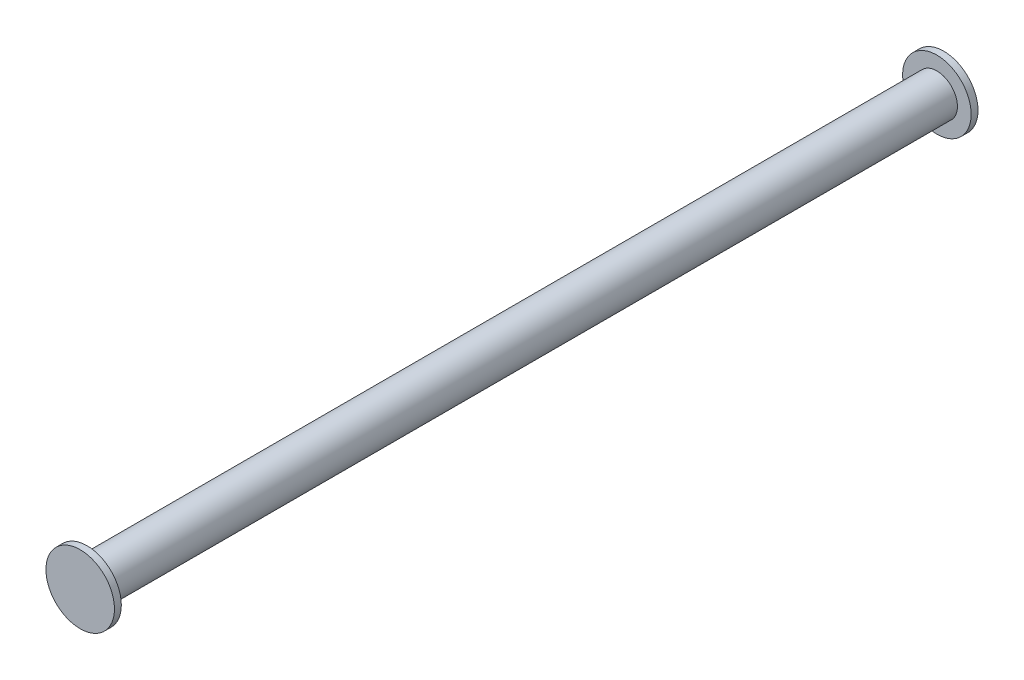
from build123d import *

# Parameters (mm, degrees)
SKETCH_1_R                  = 10
PIN_WITH_END_CAPS_DEPTH     = 126
SKETCH_2_R                  = 12
SKETCH_2_R_2                = 6
SHAFT_D12_ENDCAPS_D20_DEPTH = 124


with BuildPart() as part:
    # Sketch 1 → Pin_With_End_Caps (new, symmetric)
    with BuildSketch(Plane.XY):
        Circle(SKETCH_1_R)
    extrude(amount=PIN_WITH_END_CAPS_DEPTH, both=True)

    # Sketch 2 → Shaft_D12_EndCaps_D20 (cut, symmetric)
    with BuildSketch(Plane.XY):
        Circle(SKETCH_2_R)
        Circle(SKETCH_2_R_2, mode=Mode.SUBTRACT)
    extrude(amount=SHAFT_D12_ENDCAPS_D20_DEPTH, both=True, mode=Mode.SUBTRACT)


solid = part.part
